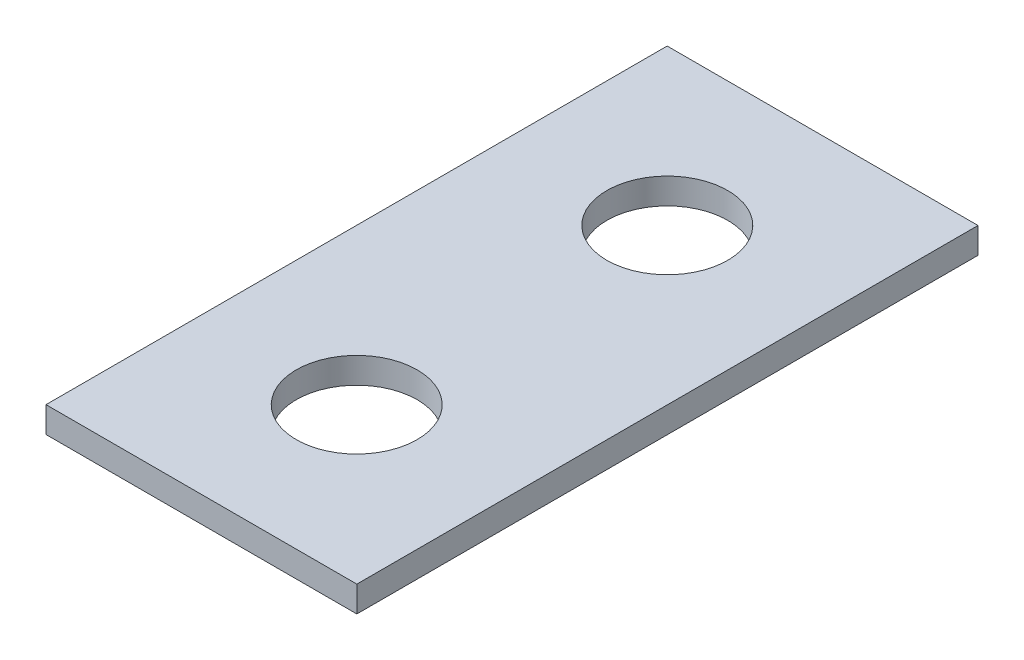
ISO-10303-21;
HEADER;
FILE_DESCRIPTION(('STEP AP214'),'2;1');
FILE_NAME('part.step','',(''),(''),'','','');
FILE_SCHEMA(('AUTOMOTIVE_DESIGN { 1 0 10303 214 1 1 1 1 }'));
ENDSEC;
DATA;
#1=APPLICATION_CONTEXT('core data for automotive mechanical design processes');
#2=APPLICATION_PROTOCOL_DEFINITION('international standard','automotive_design',2000,#1);
#3=PRODUCT_CONTEXT('',#1,'mechanical');
#4=PRODUCT('Part','Part','',(#3));
#5=PRODUCT_RELATED_PRODUCT_CATEGORY('part','',(#4));
#6=PRODUCT_DEFINITION_FORMATION('','',#4);
#7=PRODUCT_DEFINITION_CONTEXT('part definition',#1,'design');
#8=PRODUCT_DEFINITION('design','',#6,#7);
#9=PRODUCT_DEFINITION_SHAPE('','',#8);
#10=(LENGTH_UNIT() NAMED_UNIT(*) SI_UNIT(.MILLI.,.METRE.));
#11=(NAMED_UNIT(*) PLANE_ANGLE_UNIT() SI_UNIT($,.RADIAN.));
#12=(NAMED_UNIT(*) SI_UNIT($,.STERADIAN.) SOLID_ANGLE_UNIT());
#13=UNCERTAINTY_MEASURE_WITH_UNIT(LENGTH_MEASURE(1.E-05),#10,'distance_accuracy_value','');
#14=(GEOMETRIC_REPRESENTATION_CONTEXT(3) GLOBAL_UNCERTAINTY_ASSIGNED_CONTEXT((#13)) GLOBAL_UNIT_ASSIGNED_CONTEXT((#10,
#11,#12)) REPRESENTATION_CONTEXT('',''));
#15=CARTESIAN_POINT('',(0.,0.,0.));
#16=DIRECTION('',(0.,0.,1.));
#17=DIRECTION('',(1.,0.,0.));
#18=AXIS2_PLACEMENT_3D('',#15,#16,#17);
#19=CARTESIAN_POINT('',(4.76631,0.79375,9.525));
#20=DIRECTION('',(-1.,0.,0.));
#21=DIRECTION('',(0.,0.,1.));
#22=AXIS2_PLACEMENT_3D('',#19,#20,#21);
#23=PLANE('',#22);
#24=DIRECTION('',(0.,0.,-1.));
#25=VECTOR('',#24,1.);
#26=CARTESIAN_POINT('',(4.76631,0.,9.525));
#27=LINE('',#26,#25);
#28=CARTESIAN_POINT('',(4.76631,0.,9.525));
#29=VERTEX_POINT('',#28);
#30=CARTESIAN_POINT('',(4.76631,0.,-9.525));
#31=VERTEX_POINT('',#30);
#32=EDGE_CURVE('E98',#29,#31,#27,.T.);
#33=ORIENTED_EDGE('',*,*,#32,.T.);
#34=DIRECTION('',(0.,-1.,0.));
#35=VECTOR('',#34,1.);
#36=CARTESIAN_POINT('',(4.76631,0.79375,-9.525));
#37=LINE('',#36,#35);
#38=CARTESIAN_POINT('',(4.76631,0.79375,-9.525));
#39=VERTEX_POINT('',#38);
#40=EDGE_CURVE('E11',#39,#31,#37,.T.);
#41=ORIENTED_EDGE('',*,*,#40,.F.);
#42=DIRECTION('',(0.,0.,-1.));
#43=VECTOR('',#42,1.);
#44=CARTESIAN_POINT('',(4.76631,0.79375,9.525));
#45=LINE('',#44,#43);
#46=CARTESIAN_POINT('',(4.76631,0.79375,9.525));
#47=VERTEX_POINT('',#46);
#48=EDGE_CURVE('E86',#47,#39,#45,.T.);
#49=ORIENTED_EDGE('',*,*,#48,.F.);
#50=DIRECTION('',(0.,-1.,0.));
#51=VECTOR('',#50,1.);
#52=CARTESIAN_POINT('',(4.76631,0.79375,9.525));
#53=LINE('',#52,#51);
#54=EDGE_CURVE('E94',#47,#29,#53,.T.);
#55=ORIENTED_EDGE('',*,*,#54,.T.);
#56=EDGE_LOOP('',(#33,#41,#49,#55));
#57=FACE_BOUND('',#56,.T.);
#58=ADVANCED_FACE('F35',(#57),#23,.F.);
#59=CARTESIAN_POINT('',(-4.76631,0.79375,-9.525));
#60=DIRECTION('',(0.,0.,1.));
#61=DIRECTION('',(1.,0.,0.));
#62=AXIS2_PLACEMENT_3D('',#59,#60,#61);
#63=PLANE('',#62);
#64=DIRECTION('',(-1.,0.,0.));
#65=VECTOR('',#64,1.);
#66=CARTESIAN_POINT('',(-4.76631,0.,-9.525));
#67=LINE('',#66,#65);
#68=CARTESIAN_POINT('',(-4.76631,0.,-9.525));
#69=VERTEX_POINT('',#68);
#70=EDGE_CURVE('E90',#31,#69,#67,.T.);
#71=ORIENTED_EDGE('',*,*,#70,.T.);
#72=DIRECTION('',(0.,-1.,0.));
#73=VECTOR('',#72,1.);
#74=CARTESIAN_POINT('',(-4.76631,0.79375,-9.525));
#75=LINE('',#74,#73);
#76=CARTESIAN_POINT('',(-4.76631,0.79375,-9.525));
#77=VERTEX_POINT('',#76);
#78=EDGE_CURVE('E43',#77,#69,#75,.T.);
#79=ORIENTED_EDGE('',*,*,#78,.F.);
#80=DIRECTION('',(-1.,0.,0.));
#81=VECTOR('',#80,1.);
#82=CARTESIAN_POINT('',(-4.76631,0.79375,-9.525));
#83=LINE('',#82,#81);
#84=EDGE_CURVE('E81',#39,#77,#83,.T.);
#85=ORIENTED_EDGE('',*,*,#84,.F.);
#86=ORIENTED_EDGE('',*,*,#40,.T.);
#87=EDGE_LOOP('',(#71,#79,#85,#86));
#88=FACE_BOUND('',#87,.T.);
#89=ADVANCED_FACE('F89',(#88),#63,.F.);
#90=CARTESIAN_POINT('',(-4.76631,0.79375,9.525));
#91=DIRECTION('',(1.,0.,0.));
#92=DIRECTION('',(0.,0.,-1.));
#93=AXIS2_PLACEMENT_3D('',#90,#91,#92);
#94=PLANE('',#93);
#95=DIRECTION('',(0.,0.,1.));
#96=VECTOR('',#95,1.);
#97=CARTESIAN_POINT('',(-4.76631,0.,9.525));
#98=LINE('',#97,#96);
#99=CARTESIAN_POINT('',(-4.76631,0.,9.525));
#100=VERTEX_POINT('',#99);
#101=EDGE_CURVE('E68',#69,#100,#98,.T.);
#102=ORIENTED_EDGE('',*,*,#101,.T.);
#103=DIRECTION('',(0.,-1.,0.));
#104=VECTOR('',#103,1.);
#105=CARTESIAN_POINT('',(-4.76631,0.79375,9.525));
#106=LINE('',#105,#104);
#107=CARTESIAN_POINT('',(-4.76631,0.79375,9.525));
#108=VERTEX_POINT('',#107);
#109=EDGE_CURVE('E91',#108,#100,#106,.T.);
#110=ORIENTED_EDGE('',*,*,#109,.F.);
#111=DIRECTION('',(0.,0.,1.));
#112=VECTOR('',#111,1.);
#113=CARTESIAN_POINT('',(-4.76631,0.79375,9.525));
#114=LINE('',#113,#112);
#115=EDGE_CURVE('E84',#77,#108,#114,.T.);
#116=ORIENTED_EDGE('',*,*,#115,.F.);
#117=ORIENTED_EDGE('',*,*,#78,.T.);
#118=EDGE_LOOP('',(#102,#110,#116,#117));
#119=FACE_BOUND('',#118,.T.);
#120=ADVANCED_FACE('F92',(#119),#94,.F.);
#121=CARTESIAN_POINT('',(-4.76631,0.79375,9.525));
#122=DIRECTION('',(0.,0.,-1.));
#123=DIRECTION('',(-1.,0.,0.));
#124=AXIS2_PLACEMENT_3D('',#121,#122,#123);
#125=PLANE('',#124);
#126=DIRECTION('',(1.,0.,0.));
#127=VECTOR('',#126,1.);
#128=CARTESIAN_POINT('',(-4.76631,0.,9.525));
#129=LINE('',#128,#127);
#130=EDGE_CURVE('E74',#100,#29,#129,.T.);
#131=ORIENTED_EDGE('',*,*,#130,.T.);
#132=ORIENTED_EDGE('',*,*,#54,.F.);
#133=DIRECTION('',(1.,0.,0.));
#134=VECTOR('',#133,1.);
#135=CARTESIAN_POINT('',(-4.76631,0.79375,9.525));
#136=LINE('',#135,#134);
#137=EDGE_CURVE('E51',#108,#47,#136,.T.);
#138=ORIENTED_EDGE('',*,*,#137,.F.);
#139=ORIENTED_EDGE('',*,*,#109,.T.);
#140=EDGE_LOOP('',(#131,#132,#138,#139));
#141=FACE_BOUND('',#140,.T.);
#142=ADVANCED_FACE('F106',(#141),#125,.F.);
#143=CARTESIAN_POINT('',(0.,0.79375,0.));
#144=DIRECTION('',(0.,-1.,0.));
#145=DIRECTION('',(0.,0.,-1.));
#146=AXIS2_PLACEMENT_3D('',#143,#144,#145);
#147=PLANE('',#146);
#148=CARTESIAN_POINT('',(0.,0.79375,4.7625));
#149=DIRECTION('',(0.,1.,0.));
#150=DIRECTION('',(0.,0.,-1.));
#151=AXIS2_PLACEMENT_3D('',#148,#149,#150);
#152=CIRCLE('',#151,1.8542);
#153=CARTESIAN_POINT('',(0.,0.79375,2.9083));
#154=VERTEX_POINT('',#153);
#155=EDGE_CURVE('E118',#154,#154,#152,.T.);
#156=ORIENTED_EDGE('',*,*,#155,.F.);
#157=EDGE_LOOP('',(#156));
#158=FACE_BOUND('',#157,.T.);
#159=CARTESIAN_POINT('',(0.,0.79375,-4.7625));
#160=DIRECTION('',(0.,1.,0.));
#161=DIRECTION('',(0.,0.,1.));
#162=AXIS2_PLACEMENT_3D('',#159,#160,#161);
#163=CIRCLE('',#162,1.8542);
#164=CARTESIAN_POINT('',(0.,0.79375,-2.9083));
#165=VERTEX_POINT('',#164);
#166=EDGE_CURVE('E112',#165,#165,#163,.T.);
#167=ORIENTED_EDGE('',*,*,#166,.F.);
#168=EDGE_LOOP('',(#167));
#169=FACE_BOUND('',#168,.T.);
#170=ORIENTED_EDGE('',*,*,#48,.T.);
#171=ORIENTED_EDGE('',*,*,#84,.T.);
#172=ORIENTED_EDGE('',*,*,#115,.T.);
#173=ORIENTED_EDGE('',*,*,#137,.T.);
#174=EDGE_LOOP('',(#170,#171,#172,#173));
#175=FACE_BOUND('',#174,.T.);
#176=ADVANCED_FACE('F82',(#158,#169,#175),#147,.F.);
#177=CARTESIAN_POINT('',(0.,0.,0.));
#178=DIRECTION('',(0.,-1.,0.));
#179=DIRECTION('',(0.,0.,-1.));
#180=AXIS2_PLACEMENT_3D('',#177,#178,#179);
#181=PLANE('',#180);
#182=CARTESIAN_POINT('',(0.,0.,4.7625));
#183=DIRECTION('',(0.,1.,0.));
#184=DIRECTION('',(0.,0.,-1.));
#185=AXIS2_PLACEMENT_3D('',#182,#183,#184);
#186=CIRCLE('',#185,1.8542);
#187=CARTESIAN_POINT('',(0.,0.,2.9083));
#188=VERTEX_POINT('',#187);
#189=EDGE_CURVE('E115',#188,#188,#186,.T.);
#190=ORIENTED_EDGE('',*,*,#189,.T.);
#191=EDGE_LOOP('',(#190));
#192=FACE_BOUND('',#191,.T.);
#193=CARTESIAN_POINT('',(0.,0.,-4.7625));
#194=DIRECTION('',(0.,1.,0.));
#195=DIRECTION('',(0.,0.,1.));
#196=AXIS2_PLACEMENT_3D('',#193,#194,#195);
#197=CIRCLE('',#196,1.8542);
#198=CARTESIAN_POINT('',(0.,0.,-2.9083));
#199=VERTEX_POINT('',#198);
#200=EDGE_CURVE('E101',#199,#199,#197,.T.);
#201=ORIENTED_EDGE('',*,*,#200,.T.);
#202=EDGE_LOOP('',(#201));
#203=FACE_BOUND('',#202,.T.);
#204=ORIENTED_EDGE('',*,*,#32,.F.);
#205=ORIENTED_EDGE('',*,*,#130,.F.);
#206=ORIENTED_EDGE('',*,*,#101,.F.);
#207=ORIENTED_EDGE('',*,*,#70,.F.);
#208=EDGE_LOOP('',(#204,#205,#206,#207));
#209=FACE_BOUND('',#208,.T.);
#210=ADVANCED_FACE('F109',(#192,#203,#209),#181,.T.);
#211=CARTESIAN_POINT('',(0.,0.,-4.7625));
#212=DIRECTION('',(0.,1.,0.));
#213=DIRECTION('',(0.,0.,1.));
#214=AXIS2_PLACEMENT_3D('',#211,#212,#213);
#215=CYLINDRICAL_SURFACE('',#214,1.8542);
#216=ORIENTED_EDGE('',*,*,#200,.F.);
#217=EDGE_LOOP('',(#216));
#218=FACE_BOUND('',#217,.T.);
#219=ORIENTED_EDGE('',*,*,#166,.T.);
#220=EDGE_LOOP('',(#219));
#221=FACE_BOUND('',#220,.T.);
#222=ADVANCED_FACE('F129',(#218,#221),#215,.F.);
#223=CARTESIAN_POINT('',(0.,0.,4.7625));
#224=DIRECTION('',(0.,1.,0.));
#225=DIRECTION('',(0.,0.,1.));
#226=AXIS2_PLACEMENT_3D('',#223,#224,#225);
#227=CYLINDRICAL_SURFACE('',#226,1.8542);
#228=ORIENTED_EDGE('',*,*,#189,.F.);
#229=EDGE_LOOP('',(#228));
#230=FACE_BOUND('',#229,.T.);
#231=ORIENTED_EDGE('',*,*,#155,.T.);
#232=EDGE_LOOP('',(#231));
#233=FACE_BOUND('',#232,.T.);
#234=ADVANCED_FACE('F126',(#230,#233),#227,.F.);
#235=CLOSED_SHELL('',(#58,#89,#120,#142,#176,#210,#222,#234));
#236=MANIFOLD_SOLID_BREP('B2',#235);
#237=ADVANCED_BREP_SHAPE_REPRESENTATION('',(#18,#236),#14);
#238=SHAPE_DEFINITION_REPRESENTATION(#9,#237);
ENDSEC;
END-ISO-10303-21;
